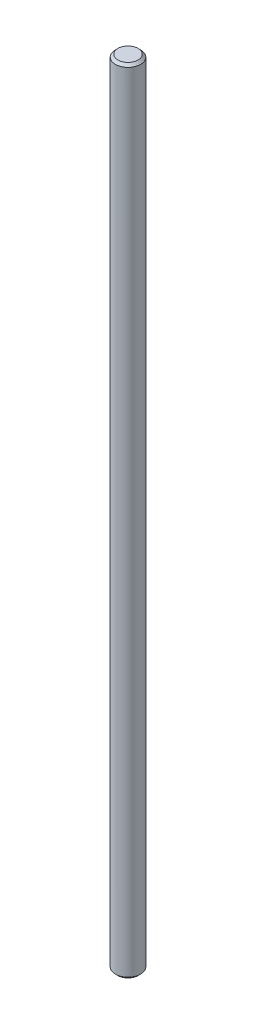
from build123d import *

# Parameters (mm, degrees)
SKETCH1_R      = 2
EXTRUDE1_DEPTH = 126
CHAMFER1_SIZE  = 0.4


with BuildPart() as part:
    # Sketch1 → Extrude1 (new body)
    with BuildSketch(Plane(origin=(0, 0, 0), x_dir=(1, 0, 0), z_dir=(0, 1, 0))):
        with Locations(Location((0, 0, 0), (0, 0, 270))):
            Circle(SKETCH1_R)
    extrude(amount=EXTRUDE1_DEPTH)

    # Chamfer1
    chamfer1_edges = [part.edges().sort_by_distance(p)[0] for p in [
        (0, 0, -2),
        (0, 126, -2),
    ]]
    chamfer(chamfer1_edges, length=CHAMFER1_SIZE)


solid = part.part
